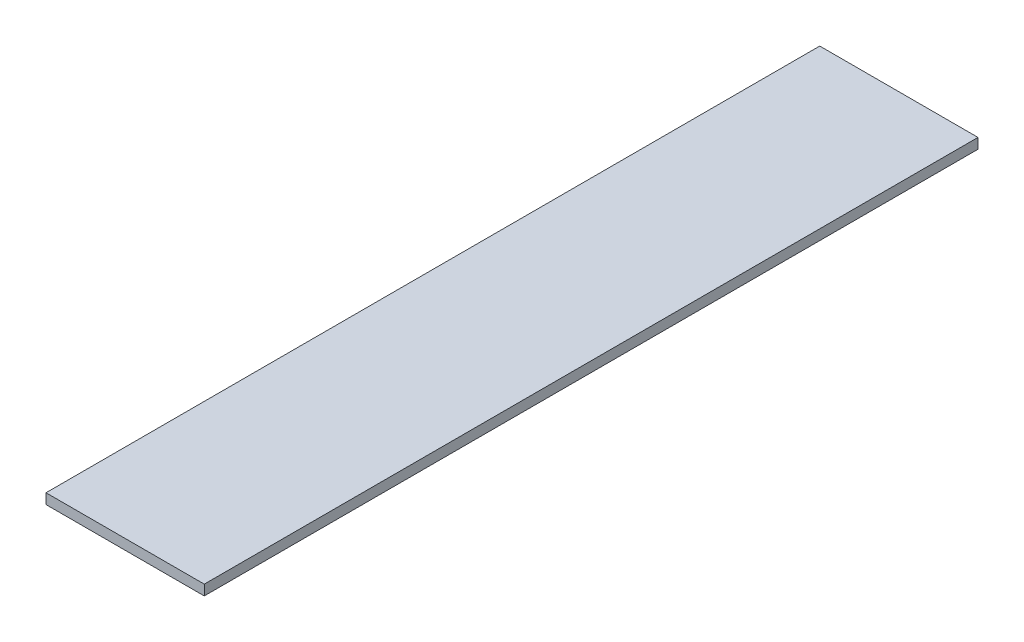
ISO-10303-21;
HEADER;
FILE_DESCRIPTION(('STEP AP214'),'2;1');
FILE_NAME('part.step','',(''),(''),'','','');
FILE_SCHEMA(('AUTOMOTIVE_DESIGN { 1 0 10303 214 1 1 1 1 }'));
ENDSEC;
DATA;
#1=APPLICATION_CONTEXT('core data for automotive mechanical design processes');
#2=APPLICATION_PROTOCOL_DEFINITION('international standard','automotive_design',2000,#1);
#3=PRODUCT_CONTEXT('',#1,'mechanical');
#4=PRODUCT('Part','Part','',(#3));
#5=PRODUCT_RELATED_PRODUCT_CATEGORY('part','',(#4));
#6=PRODUCT_DEFINITION_FORMATION('','',#4);
#7=PRODUCT_DEFINITION_CONTEXT('part definition',#1,'design');
#8=PRODUCT_DEFINITION('design','',#6,#7);
#9=PRODUCT_DEFINITION_SHAPE('','',#8);
#10=(LENGTH_UNIT() NAMED_UNIT(*) SI_UNIT(.MILLI.,.METRE.));
#11=(NAMED_UNIT(*) PLANE_ANGLE_UNIT() SI_UNIT($,.RADIAN.));
#12=(NAMED_UNIT(*) SI_UNIT($,.STERADIAN.) SOLID_ANGLE_UNIT());
#13=UNCERTAINTY_MEASURE_WITH_UNIT(LENGTH_MEASURE(1.E-05),#10,'distance_accuracy_value','');
#14=(GEOMETRIC_REPRESENTATION_CONTEXT(3) GLOBAL_UNCERTAINTY_ASSIGNED_CONTEXT((#13)) GLOBAL_UNIT_ASSIGNED_CONTEXT((#10,
#11,#12)) REPRESENTATION_CONTEXT('',''));
#15=CARTESIAN_POINT('',(0.,0.,0.));
#16=DIRECTION('',(0.,0.,1.));
#17=DIRECTION('',(1.,0.,0.));
#18=AXIS2_PLACEMENT_3D('',#15,#16,#17);
#19=CARTESIAN_POINT('',(42.8625,5.55625,-209.55));
#20=DIRECTION('',(-1.,0.,0.));
#21=DIRECTION('',(0.,0.,1.));
#22=AXIS2_PLACEMENT_3D('',#19,#20,#21);
#23=PLANE('',#22);
#24=DIRECTION('',(0.,0.,-1.));
#25=VECTOR('',#24,1.);
#26=CARTESIAN_POINT('',(42.8625,0.,-209.55));
#27=LINE('',#26,#25);
#28=CARTESIAN_POINT('',(42.8625,0.,209.55));
#29=VERTEX_POINT('',#28);
#30=CARTESIAN_POINT('',(42.8625,0.,-209.55));
#31=VERTEX_POINT('',#30);
#32=EDGE_CURVE('E95',#29,#31,#27,.T.);
#33=ORIENTED_EDGE('',*,*,#32,.T.);
#34=DIRECTION('',(0.,-1.,0.));
#35=VECTOR('',#34,1.);
#36=CARTESIAN_POINT('',(42.8625,5.55625,-209.55));
#37=LINE('',#36,#35);
#38=CARTESIAN_POINT('',(42.8625,5.55625,-209.55));
#39=VERTEX_POINT('',#38);
#40=EDGE_CURVE('E11',#39,#31,#37,.T.);
#41=ORIENTED_EDGE('',*,*,#40,.F.);
#42=DIRECTION('',(0.,0.,-1.));
#43=VECTOR('',#42,1.);
#44=CARTESIAN_POINT('',(42.8625,5.55625,-209.55));
#45=LINE('',#44,#43);
#46=CARTESIAN_POINT('',(42.8625,5.55625,209.55));
#47=VERTEX_POINT('',#46);
#48=EDGE_CURVE('E83',#47,#39,#45,.T.);
#49=ORIENTED_EDGE('',*,*,#48,.F.);
#50=DIRECTION('',(0.,-1.,0.));
#51=VECTOR('',#50,1.);
#52=CARTESIAN_POINT('',(42.8625,5.55625,209.55));
#53=LINE('',#52,#51);
#54=EDGE_CURVE('E91',#47,#29,#53,.T.);
#55=ORIENTED_EDGE('',*,*,#54,.T.);
#56=EDGE_LOOP('',(#33,#41,#49,#55));
#57=FACE_BOUND('',#56,.T.);
#58=ADVANCED_FACE('F32',(#57),#23,.F.);
#59=CARTESIAN_POINT('',(-42.8625,5.55625,-209.55));
#60=DIRECTION('',(0.,0.,1.));
#61=DIRECTION('',(1.,0.,0.));
#62=AXIS2_PLACEMENT_3D('',#59,#60,#61);
#63=PLANE('',#62);
#64=DIRECTION('',(-1.,0.,0.));
#65=VECTOR('',#64,1.);
#66=CARTESIAN_POINT('',(-42.8625,0.,-209.55));
#67=LINE('',#66,#65);
#68=CARTESIAN_POINT('',(-42.8625,0.,-209.55));
#69=VERTEX_POINT('',#68);
#70=EDGE_CURVE('E87',#31,#69,#67,.T.);
#71=ORIENTED_EDGE('',*,*,#70,.T.);
#72=DIRECTION('',(0.,-1.,0.));
#73=VECTOR('',#72,1.);
#74=CARTESIAN_POINT('',(-42.8625,5.55625,-209.55));
#75=LINE('',#74,#73);
#76=CARTESIAN_POINT('',(-42.8625,5.55625,-209.55));
#77=VERTEX_POINT('',#76);
#78=EDGE_CURVE('E40',#77,#69,#75,.T.);
#79=ORIENTED_EDGE('',*,*,#78,.F.);
#80=DIRECTION('',(-1.,0.,0.));
#81=VECTOR('',#80,1.);
#82=CARTESIAN_POINT('',(-42.8625,5.55625,-209.55));
#83=LINE('',#82,#81);
#84=EDGE_CURVE('E78',#39,#77,#83,.T.);
#85=ORIENTED_EDGE('',*,*,#84,.F.);
#86=ORIENTED_EDGE('',*,*,#40,.T.);
#87=EDGE_LOOP('',(#71,#79,#85,#86));
#88=FACE_BOUND('',#87,.T.);
#89=ADVANCED_FACE('F86',(#88),#63,.F.);
#90=CARTESIAN_POINT('',(-42.8625,5.55625,-209.55));
#91=DIRECTION('',(1.,0.,0.));
#92=DIRECTION('',(0.,0.,-1.));
#93=AXIS2_PLACEMENT_3D('',#90,#91,#92);
#94=PLANE('',#93);
#95=DIRECTION('',(0.,0.,1.));
#96=VECTOR('',#95,1.);
#97=CARTESIAN_POINT('',(-42.8625,0.,-209.55));
#98=LINE('',#97,#96);
#99=CARTESIAN_POINT('',(-42.8625,0.,209.55));
#100=VERTEX_POINT('',#99);
#101=EDGE_CURVE('E65',#69,#100,#98,.T.);
#102=ORIENTED_EDGE('',*,*,#101,.T.);
#103=DIRECTION('',(0.,-1.,0.));
#104=VECTOR('',#103,1.);
#105=CARTESIAN_POINT('',(-42.8625,5.55625,209.55));
#106=LINE('',#105,#104);
#107=CARTESIAN_POINT('',(-42.8625,5.55625,209.55));
#108=VERTEX_POINT('',#107);
#109=EDGE_CURVE('E88',#108,#100,#106,.T.);
#110=ORIENTED_EDGE('',*,*,#109,.F.);
#111=DIRECTION('',(0.,0.,1.));
#112=VECTOR('',#111,1.);
#113=CARTESIAN_POINT('',(-42.8625,5.55625,-209.55));
#114=LINE('',#113,#112);
#115=EDGE_CURVE('E81',#77,#108,#114,.T.);
#116=ORIENTED_EDGE('',*,*,#115,.F.);
#117=ORIENTED_EDGE('',*,*,#78,.T.);
#118=EDGE_LOOP('',(#102,#110,#116,#117));
#119=FACE_BOUND('',#118,.T.);
#120=ADVANCED_FACE('F89',(#119),#94,.F.);
#121=CARTESIAN_POINT('',(-42.8625,5.55625,209.55));
#122=DIRECTION('',(0.,0.,-1.));
#123=DIRECTION('',(-1.,0.,0.));
#124=AXIS2_PLACEMENT_3D('',#121,#122,#123);
#125=PLANE('',#124);
#126=DIRECTION('',(1.,0.,0.));
#127=VECTOR('',#126,1.);
#128=CARTESIAN_POINT('',(-42.8625,0.,209.55));
#129=LINE('',#128,#127);
#130=EDGE_CURVE('E71',#100,#29,#129,.T.);
#131=ORIENTED_EDGE('',*,*,#130,.T.);
#132=ORIENTED_EDGE('',*,*,#54,.F.);
#133=DIRECTION('',(1.,0.,0.));
#134=VECTOR('',#133,1.);
#135=CARTESIAN_POINT('',(-42.8625,5.55625,209.55));
#136=LINE('',#135,#134);
#137=EDGE_CURVE('E48',#108,#47,#136,.T.);
#138=ORIENTED_EDGE('',*,*,#137,.F.);
#139=ORIENTED_EDGE('',*,*,#109,.T.);
#140=EDGE_LOOP('',(#131,#132,#138,#139));
#141=FACE_BOUND('',#140,.T.);
#142=ADVANCED_FACE('F102',(#141),#125,.F.);
#143=CARTESIAN_POINT('',(0.,5.55625,0.));
#144=DIRECTION('',(0.,1.,0.));
#145=DIRECTION('',(0.,0.,1.));
#146=AXIS2_PLACEMENT_3D('',#143,#144,#145);
#147=PLANE('',#146);
#148=ORIENTED_EDGE('',*,*,#48,.T.);
#149=ORIENTED_EDGE('',*,*,#84,.T.);
#150=ORIENTED_EDGE('',*,*,#115,.T.);
#151=ORIENTED_EDGE('',*,*,#137,.T.);
#152=EDGE_LOOP('',(#148,#149,#150,#151));
#153=FACE_BOUND('',#152,.T.);
#154=ADVANCED_FACE('F79',(#153),#147,.T.);
#155=CARTESIAN_POINT('',(0.,0.,0.));
#156=DIRECTION('',(0.,1.,0.));
#157=DIRECTION('',(0.,0.,1.));
#158=AXIS2_PLACEMENT_3D('',#155,#156,#157);
#159=PLANE('',#158);
#160=ORIENTED_EDGE('',*,*,#32,.F.);
#161=ORIENTED_EDGE('',*,*,#130,.F.);
#162=ORIENTED_EDGE('',*,*,#101,.F.);
#163=ORIENTED_EDGE('',*,*,#70,.F.);
#164=EDGE_LOOP('',(#160,#161,#162,#163));
#165=FACE_BOUND('',#164,.T.);
#166=ADVANCED_FACE('F105',(#165),#159,.F.);
#167=CLOSED_SHELL('',(#58,#89,#120,#142,#154,#166));
#168=MANIFOLD_SOLID_BREP('B2',#167);
#169=ADVANCED_BREP_SHAPE_REPRESENTATION('',(#18,#168),#14);
#170=SHAPE_DEFINITION_REPRESENTATION(#9,#169);
ENDSEC;
END-ISO-10303-21;
